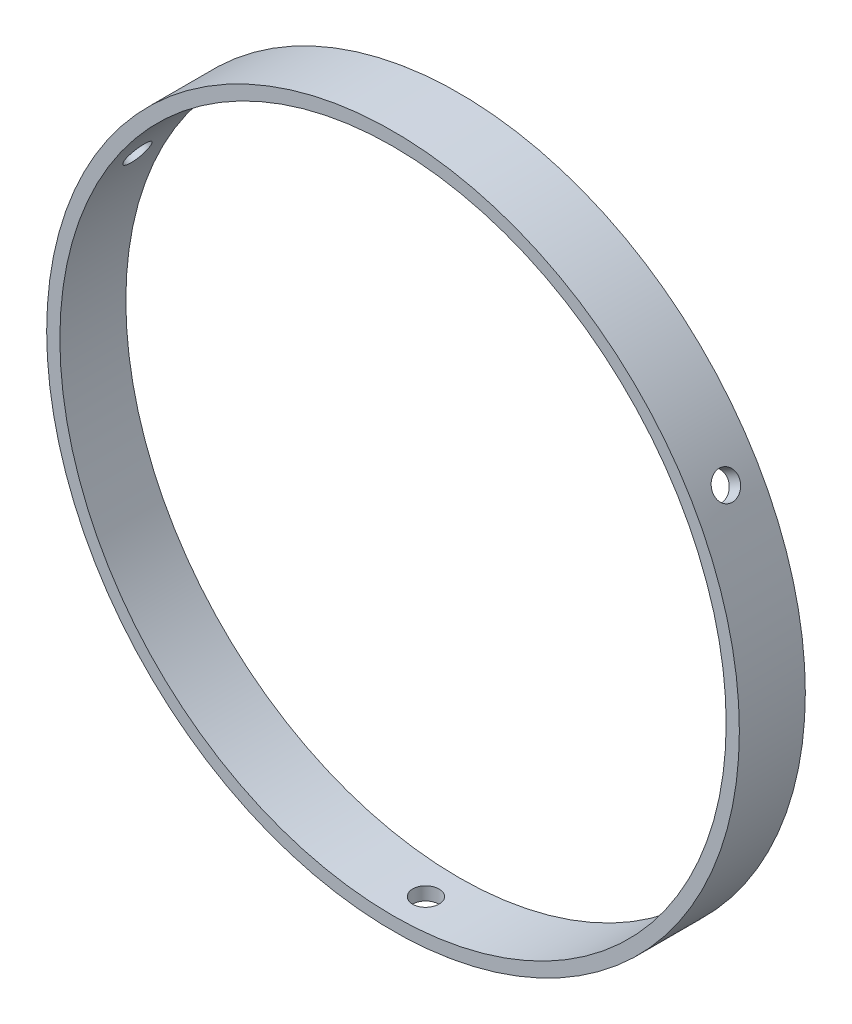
from build123d import *

# Parameters (mm, degrees)
ESQUISSE1_R                  = 52.5
ESQUISSE1_R_2                = 50.5
BOSS_EXTRU_1_DEPTH           = 5
ESQUISSE2_R                  = 2
ENL_V_MAT_EXTRU_1_DEPTH      = 75.414380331
R_P_TITION_CIRCULAIRE1_COUNT = 3


with BuildPart() as part:
    # Esquisse1 → Boss.-Extru.1 (new, symmetric)
    with BuildSketch(Plane.XY):
        Circle(ESQUISSE1_R)
        Circle(ESQUISSE1_R_2, mode=Mode.SUBTRACT)
    extrude(amount=BOSS_EXTRU_1_DEPTH, both=True)

    # Esquisse2 → Enl_v. mat.-Extru.1 (cut, through all)
    with BuildSketch(Plane(origin=(0, 0, 0), x_dir=(1, 0, 0), z_dir=(0, 1, 0))):
        with Locations(Location((0, 0, 0), (0, 0, 270))):
            Circle(ESQUISSE2_R)
    enl_v_mat_extru_1 = extrude(amount=-ENL_V_MAT_EXTRU_1_DEPTH, mode=Mode.SUBTRACT)

    # R_p_tition circulaire1: Enl_v. mat.-Extru.1 ×3 about axis
    r_p_tition_circulaire1_axis = Axis((0, 0, 5), (0, 0, -1))
    for i in range(1, R_P_TITION_CIRCULAIRE1_COUNT):
        add(enl_v_mat_extru_1.rotate(r_p_tition_circulaire1_axis, i * 360 / R_P_TITION_CIRCULAIRE1_COUNT), mode=Mode.SUBTRACT)


solid = part.part
